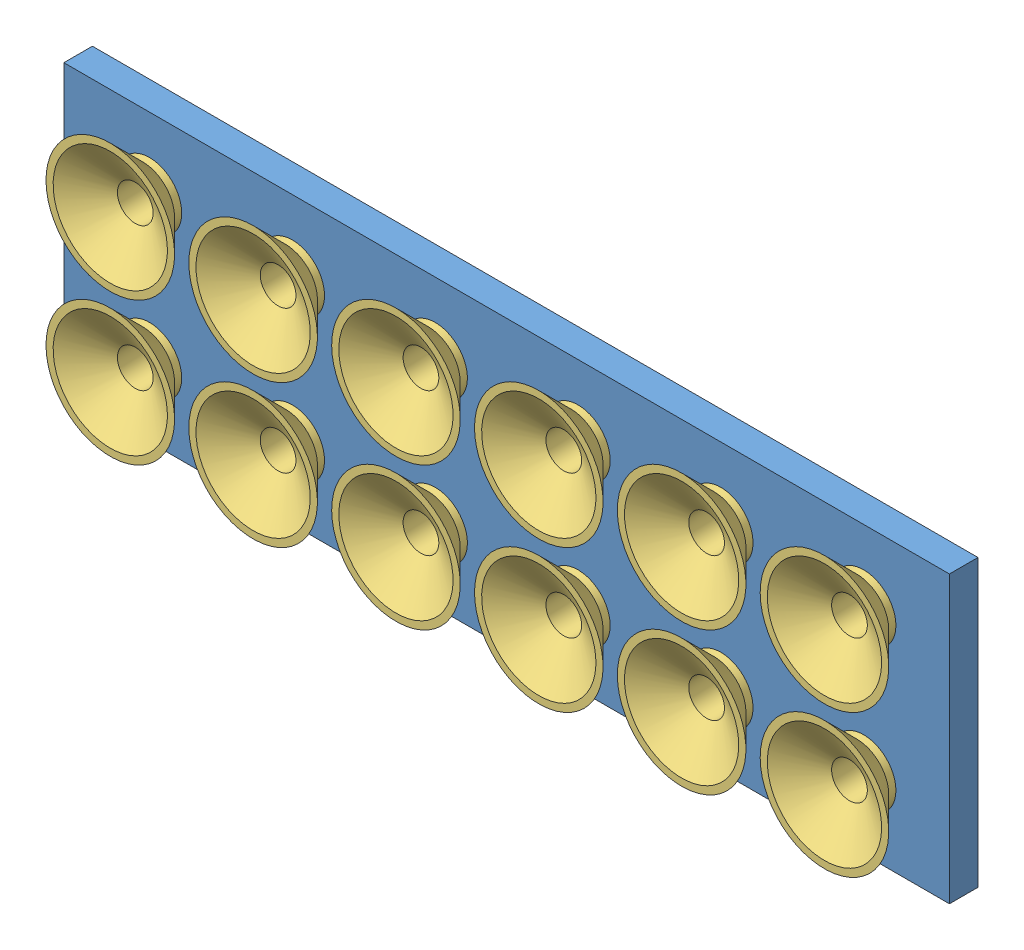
SolidWorks assembly 装配体1.sldasm, configuration 默认 (file format 9000). Lengths in mm.
Overall size (124 40.93 12.5).
37 component instances, 3 part files, 2 mates.
Components (placement in the parent):
- 吸盘板-1: 吸盘板.SLDPRT [默认] at (-70.2698 -28.4489 124) size (124 40 4)
- 吸盘，内径16-7: 吸盘，内径16.SLDASM [默认] at (53.2168 -10.245 109.5) x (0.983884 -0.178807 0) z (0 0 1) size (18 18 12.5)
  - 铁环-1: 铁环.SLDPRT [默认] at (-3.7515 1.1438 14.5) size (13 13 3)
  - 吸盘-1: 吸盘.SLDPRT [默认] at (-3.7515 1.1438 24) size (18 18 12.5)
- 吸盘，内径16-14: 吸盘，内径16.SLDASM [默认] at (53.2168 9.755 109.5) x (0.983884 -0.178807 0) z (0 0 1) size (18 18 12.5)
  - 铁环-1: 铁环.SLDPRT [默认] at (-3.7515 1.1438 14.5) size (13 13 3)
  - 吸盘-1: 吸盘.SLDPRT [默认] at (-3.7515 1.1438 24) size (18 18 12.5)
- 吸盘，内径16-15: 吸盘，内径16.SLDASM [默认] at (33.2168 -10.245 109.5) x (0.983884 -0.178807 0) z (0 0 1) size (18 18 12.5)
  - 铁环-1: 铁环.SLDPRT [默认] at (-3.7515 1.1438 14.5) size (13 13 3)
  - 吸盘-1: 吸盘.SLDPRT [默认] at (-3.7515 1.1438 24) size (18 18 12.5)
- 吸盘，内径16-16: 吸盘，内径16.SLDASM [默认] at (33.2168 9.755 109.5) x (0.983884 -0.178807 0) z (0 0 1) size (18 18 12.5)
  - 铁环-1: 铁环.SLDPRT [默认] at (-3.7515 1.1438 14.5) size (13 13 3)
  - 吸盘-1: 吸盘.SLDPRT [默认] at (-3.7515 1.1438 24) size (18 18 12.5)
- 吸盘，内径16-17: 吸盘，内径16.SLDASM [默认] at (13.2168 -10.245 109.5) x (0.983884 -0.178807 0) z (0 0 1) size (18 18 12.5)
  - 铁环-1: 铁环.SLDPRT [默认] at (-3.7515 1.1438 14.5) size (13 13 3)
  - 吸盘-1: 吸盘.SLDPRT [默认] at (-3.7515 1.1438 24) size (18 18 12.5)
- 吸盘，内径16-18: 吸盘，内径16.SLDASM [默认] at (13.2168 9.755 109.5) x (0.983884 -0.178807 0) z (0 0 1) size (18 18 12.5)
  - 铁环-1: 铁环.SLDPRT [默认] at (-3.7515 1.1438 14.5) size (13 13 3)
  - 吸盘-1: 吸盘.SLDPRT [默认] at (-3.7515 1.1438 24) size (18 18 12.5)
- 吸盘，内径16-19: 吸盘，内径16.SLDASM [默认] at (-6.7832 -10.245 109.5) x (0.983884 -0.178807 0) z (0 0 1) size (18 18 12.5)
  - 铁环-1: 铁环.SLDPRT [默认] at (-3.7515 1.1438 14.5) size (13 13 3)
  - 吸盘-1: 吸盘.SLDPRT [默认] at (-3.7515 1.1438 24) size (18 18 12.5)
- 吸盘，内径16-20: 吸盘，内径16.SLDASM [默认] at (-6.7832 9.755 109.5) x (0.983884 -0.178807 0) z (0 0 1) size (18 18 12.5)
  - 铁环-1: 铁环.SLDPRT [默认] at (-3.7515 1.1438 14.5) size (13 13 3)
  - 吸盘-1: 吸盘.SLDPRT [默认] at (-3.7515 1.1438 24) size (18 18 12.5)
- 吸盘，内径16-21: 吸盘，内径16.SLDASM [默认] at (-26.7832 -10.245 109.5) x (0.983884 -0.178807 0) z (0 0 1) size (18 18 12.5)
  - 铁环-1: 铁环.SLDPRT [默认] at (-3.7515 1.1438 14.5) size (13 13 3)
  - 吸盘-1: 吸盘.SLDPRT [默认] at (-3.7515 1.1438 24) size (18 18 12.5)
- 吸盘，内径16-22: 吸盘，内径16.SLDASM [默认] at (-26.7832 9.755 109.5) x (0.983884 -0.178807 0) z (0 0 1) size (18 18 12.5)
  - 铁环-1: 铁环.SLDPRT [默认] at (-3.7515 1.1438 14.5) size (13 13 3)
  - 吸盘-1: 吸盘.SLDPRT [默认] at (-3.7515 1.1438 24) size (18 18 12.5)
- 吸盘，内径16-23: 吸盘，内径16.SLDASM [默认] at (-46.7832 -10.245 109.5) x (0.983884 -0.178807 0) z (0 0 1) size (18 18 12.5)
  - 铁环-1: 铁环.SLDPRT [默认] at (-3.7515 1.1438 14.5) size (13 13 3)
  - 吸盘-1: 吸盘.SLDPRT [默认] at (-3.7515 1.1438 24) size (18 18 12.5)
- 吸盘，内径16-24: 吸盘，内径16.SLDASM [默认] at (-46.7832 9.755 109.5) x (0.983884 -0.178807 0) z (0 0 1) size (18 18 12.5)
  - 铁环-1: 铁环.SLDPRT [默认] at (-3.7515 1.1438 14.5) size (13 13 3)
  - 吸盘-1: 吸盘.SLDPRT [默认] at (-3.7515 1.1438 24) size (18 18 12.5)
Mates (geometry in assembly coordinates):
- 同心1: concentric aligned: cylinder of 吸盘板-1 through (49.7302 -8.4489 124) axis (0 0 1) radius 4.5; cylinder of 吸盘，内径16-7/吸盘-1 through (49.7302 -8.4489 133.5) axis (0 0 1) radius 4.5
- 重合1: coincident anti-aligned: plane of 吸盘板-1 through (-70.2698 -28.4489 124) normal (0 0 -1); plane of 吸盘，内径16-7/铁环-1 through (45.3028 -7.6442 124) normal (0 0 1)
